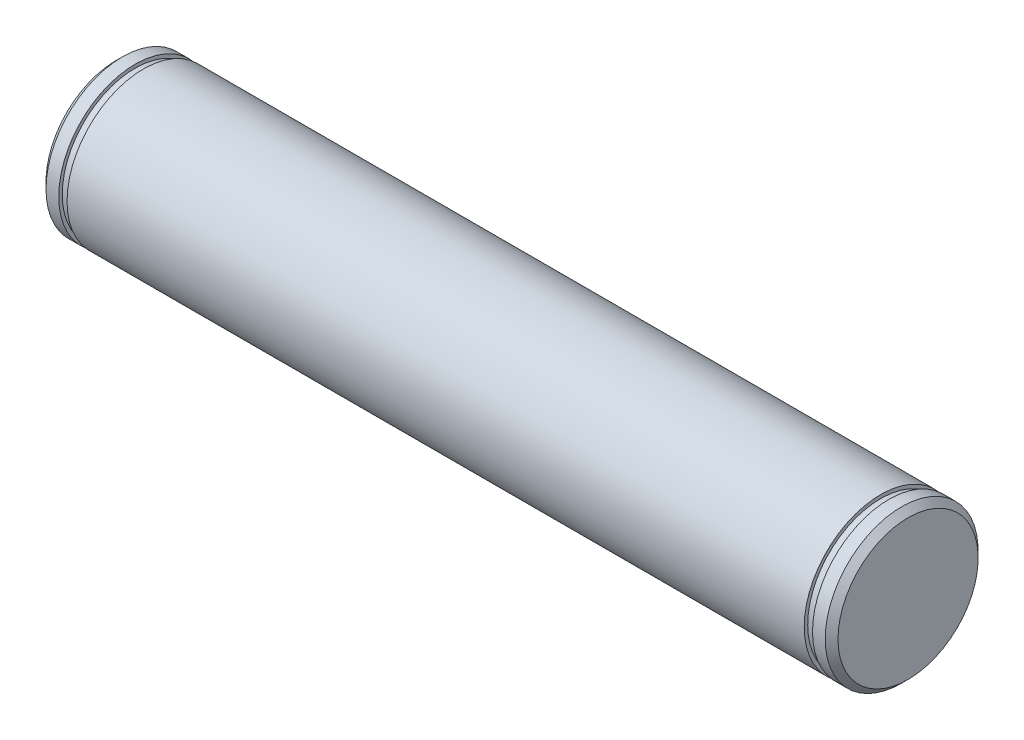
from build123d import *

# Parameters (mm, degrees)
CHANFREIN1_SIZE = 1


with BuildPart() as part:
    # Esquisse1 → Base-R_volution (revolve)
    with BuildSketch(Plane.XY, mode=Mode.PRIVATE) as base_r_volution_sk:
        Polygon((-100, 0), (-100, 12), (-97, 12), (-97, 11.45), (-95.7, 11.45), (-95.7, 12), (20.02, 12), (20.02, 11.45), (21.32, 11.45), (21.32, 12), (24.32, 12), (24.32, 0), align=None)
    revolve(base_r_volution_sk.sketch.rotate(Axis((-130, 0, 0), (1, 0, 0)), 90), axis=Axis((-130, 0, 0), (1, 0, 0)))

    # Chanfrein1
    chanfrein1_edges = [part.edges().sort_by_distance(p)[0] for p in [
        (-100, 0, -12),
        (24.32, 0, -12),
    ]]
    chamfer(chanfrein1_edges, length=CHANFREIN1_SIZE)

    # Esquisse3 → Enl_vement de mati_re-R_volution2 (revolve, cut)
    with BuildSketch(Plane.XY, mode=Mode.PRIVATE) as enl_vement_de_mati_re_r_volution2_sk:
        Polygon((-43.84, -12), (-37.84, -12), (-37.84, -6), align=None)
    revolve(enl_vement_de_mati_re_r_volution2_sk.sketch.rotate(Axis((-37.84, 12, 0), (0, -1, 0)), 90), axis=Axis((-37.84, 12, 0), (0, -1, 0)), mode=Mode.SUBTRACT)


solid = part.part
